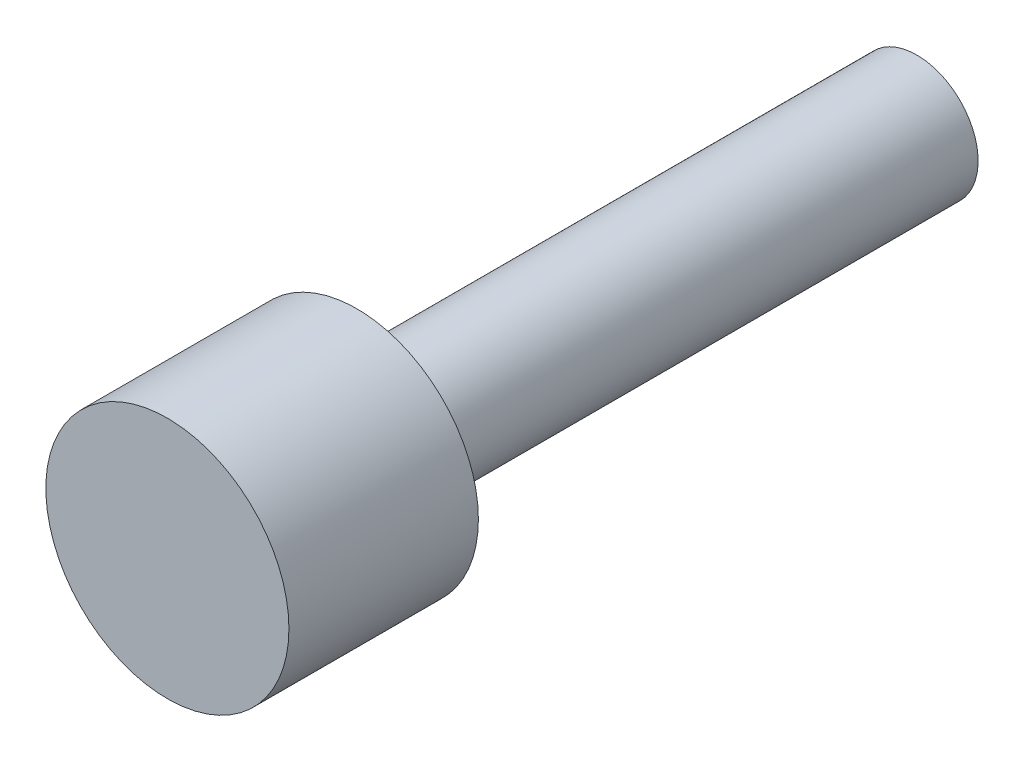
from build123d import *

# Parameters (mm, degrees)
SKETCH1_R           = 7.14375
BOSS_EXTRUDE1_DEPTH = 11.134723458
SKETCH2_R           = 3.59537
BOSS_EXTRUDE2_DEPTH = 32.918401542


with BuildPart() as part:
    # Sketch1 → Boss-Extrude1 (new body)
    with BuildSketch(Plane.XY):
        Circle(SKETCH1_R)
    extrude(amount=-BOSS_EXTRUDE1_DEPTH)

    # Sketch2 → Boss-Extrude2 (add)
    with BuildSketch(Plane(origin=(0, 0, -11.134723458), x_dir=(-1, 0, 0), z_dir=(0, 0, -1))):
        Circle(SKETCH2_R)
    extrude(amount=BOSS_EXTRUDE2_DEPTH)


solid = part.part
